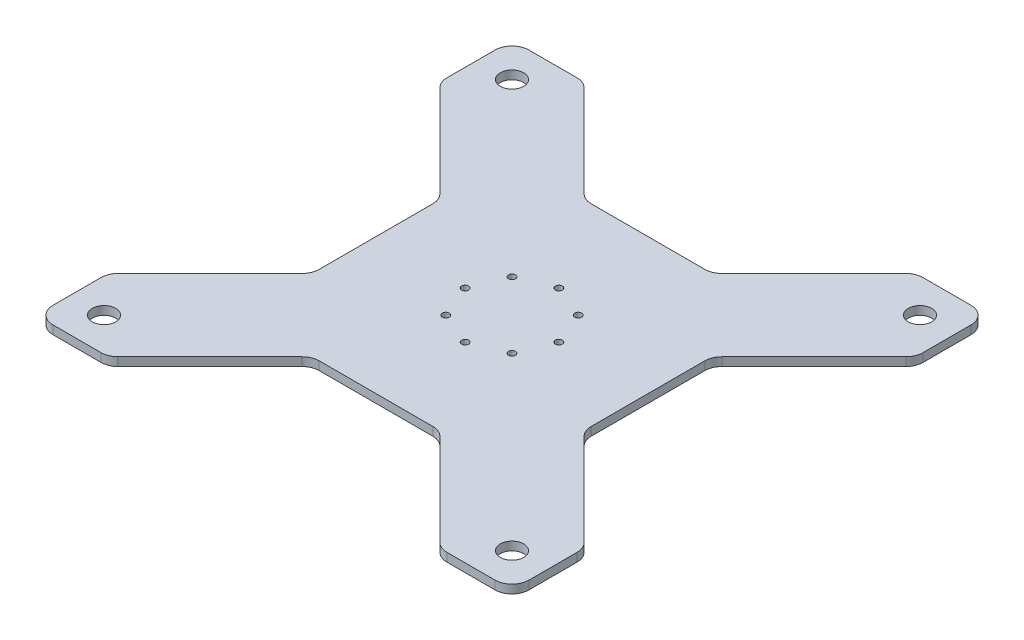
from build123d import *

# Parameters (mm, degrees)
SKETCH1_R           = 5.25
SKETCH1_R_2         = 17.5
BOSS_EXTRUDE1_DEPTH = 12.7
CIRPATTERN1_COUNT   = 4
CUT_EXTRUDE1_REACH  = 505.055
SKETCH4_R           = 5.25


with BuildPart() as part:
    # Sketch1 → Boss-Extrude1 (new body)
    with BuildSketch(Plane(origin=(0, 0, 0), x_dir=(1, 0, 0), z_dir=(0, 1, 0))):
        with BuildLine():
            Line((-330.2, 355.6), (-258.357951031, 355.6))
            ThreePointArc((-258.357951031, 355.6), (-248.637791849, 353.666540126), (-240.397438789, 348.160512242))
            Line((-240.397438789, 348.160512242), (-102.876414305, 210.639487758))
            ThreePointArc((-102.876414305, 210.639487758), (-94.636061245, 205.133459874), (-84.915902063, 203.2))
            Line((-84.915902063, 203.2), (0, 203.2))
            Line((0, 203.2), (0, 0))
            Line((0, 0), (-203.2, 0))
            Line((-203.2, 0), (-203.2, 84.915902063))
            ThreePointArc((-203.2, 84.915902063), (-205.133459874, 94.636061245), (-210.639487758, 102.876414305))
            Line((-210.639487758, 102.876414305), (-348.160512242, 240.397438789))
            ThreePointArc((-348.160512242, 240.397438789), (-353.666540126, 248.637791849), (-355.6, 258.357951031))
            Line((-355.6, 258.357951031), (-355.6, 330.2))
            ThreePointArc((-355.6, 330.2), (-348.160512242, 348.160512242), (-330.2, 355.6))
        make_face()
        with Locations(Location((-49.497474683, 49.497474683, 0), (0, 0, 270))):
            Circle(SKETCH1_R, mode=Mode.SUBTRACT)
        with Locations(Location((-304.8, 304.8, 0), (0, 0, 270))):
            Circle(SKETCH1_R_2, mode=Mode.SUBTRACT)
    boss_extrude1 = extrude(amount=BOSS_EXTRUDE1_DEPTH)

    # CirPattern1: Boss-Extrude1 ×4 about axis
    cirpattern1_axis = Axis((0, 0, 0), (0, 1, 0))
    for i in range(1, CIRPATTERN1_COUNT):
        add(boss_extrude1.rotate(cirpattern1_axis, i * 360 / CIRPATTERN1_COUNT))

    # Sketch4 → Cut-Extrude1 (cut, up to next)
    with BuildSketch(Plane(origin=(0, 12.7, 0), x_dir=(1, 0, 0), z_dir=(0, 1, 0)), mode=Mode.PRIVATE) as cut_extrude1_sk1:
        with Locations(Location((0, 70, 0), (0, 0, 270))):
            Circle(SKETCH4_R)
    cut_extrude1_tool1 = extrude(cut_extrude1_sk1.sketch, amount=-CUT_EXTRUDE1_REACH, mode=Mode.PRIVATE) & part.part
    # Sketch4 → Cut-Extrude1 (cut, up to next)
    with BuildSketch(Plane(origin=(0, 12.7, 0), x_dir=(1, 0, 0), z_dir=(0, 1, 0)), mode=Mode.PRIVATE) as cut_extrude1_sk2:
        with Locations(Location((70, 0, 0), (0, 0, 270))):
            Circle(SKETCH4_R)
    cut_extrude1_tool2 = extrude(cut_extrude1_sk2.sketch, amount=-CUT_EXTRUDE1_REACH, mode=Mode.PRIVATE) & part.part
    # Sketch4 → Cut-Extrude1 (cut, up to next)
    with BuildSketch(Plane(origin=(0, 12.7, 0), x_dir=(1, 0, 0), z_dir=(0, 1, 0)), mode=Mode.PRIVATE) as cut_extrude1_sk3:
        with Locations(Location((0, -70, 0), (0, 0, 270))):
            Circle(SKETCH4_R)
    cut_extrude1_tool3 = extrude(cut_extrude1_sk3.sketch, amount=-CUT_EXTRUDE1_REACH, mode=Mode.PRIVATE) & part.part
    # Sketch4 → Cut-Extrude1 (cut, up to next)
    with BuildSketch(Plane(origin=(0, 12.7, 0), x_dir=(1, 0, 0), z_dir=(0, 1, 0)), mode=Mode.PRIVATE) as cut_extrude1_sk4:
        with Locations(Location((-70, 0, 0), (0, 0, 270))):
            Circle(SKETCH4_R)
    cut_extrude1_tool4 = extrude(cut_extrude1_sk4.sketch, amount=-CUT_EXTRUDE1_REACH, mode=Mode.PRIVATE) & part.part
    add(cut_extrude1_tool1.solids().sort_by_distance((0, 12.7, -70))[0], mode=Mode.SUBTRACT)
    add(cut_extrude1_tool2.solids().sort_by_distance((70, 12.7, 0))[0], mode=Mode.SUBTRACT)
    add(cut_extrude1_tool3.solids().sort_by_distance((0, 12.7, 70))[0], mode=Mode.SUBTRACT)
    add(cut_extrude1_tool4.solids().sort_by_distance((-70, 12.7, 0))[0], mode=Mode.SUBTRACT)


solid = part.part
